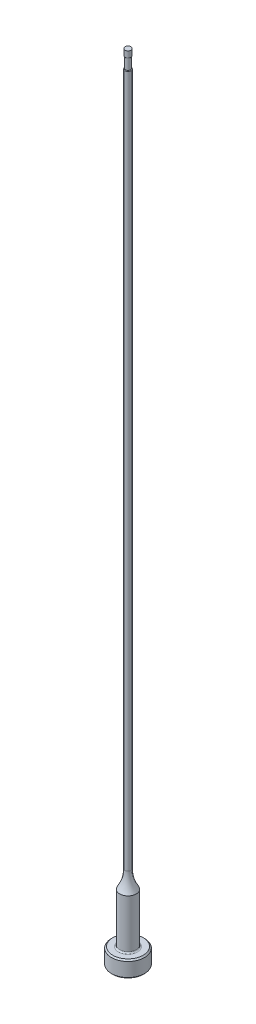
ISO-10303-21;
HEADER;
FILE_DESCRIPTION(('STEP AP214'),'2;1');
FILE_NAME('part.step','',(''),(''),'','','');
FILE_SCHEMA(('AUTOMOTIVE_DESIGN { 1 0 10303 214 1 1 1 1 }'));
ENDSEC;
DATA;
#1=APPLICATION_CONTEXT('core data for automotive mechanical design processes');
#2=APPLICATION_PROTOCOL_DEFINITION('international standard','automotive_design',2000,#1);
#3=PRODUCT_CONTEXT('',#1,'mechanical');
#4=PRODUCT('Part','Part','',(#3));
#5=PRODUCT_RELATED_PRODUCT_CATEGORY('part','',(#4));
#6=PRODUCT_DEFINITION_FORMATION('','',#4);
#7=PRODUCT_DEFINITION_CONTEXT('part definition',#1,'design');
#8=PRODUCT_DEFINITION('design','',#6,#7);
#9=PRODUCT_DEFINITION_SHAPE('','',#8);
#10=(LENGTH_UNIT() NAMED_UNIT(*) SI_UNIT(.MILLI.,.METRE.));
#11=(NAMED_UNIT(*) PLANE_ANGLE_UNIT() SI_UNIT($,.RADIAN.));
#12=(NAMED_UNIT(*) SI_UNIT($,.STERADIAN.) SOLID_ANGLE_UNIT());
#13=UNCERTAINTY_MEASURE_WITH_UNIT(LENGTH_MEASURE(1.E-05),#10,'distance_accuracy_value','');
#14=(GEOMETRIC_REPRESENTATION_CONTEXT(3) GLOBAL_UNCERTAINTY_ASSIGNED_CONTEXT((#13)) GLOBAL_UNIT_ASSIGNED_CONTEXT((#10,
#11,#12)) REPRESENTATION_CONTEXT('',''));
#15=CARTESIAN_POINT('',(0.,0.,0.));
#16=DIRECTION('',(0.,0.,1.));
#17=DIRECTION('',(1.,0.,0.));
#18=AXIS2_PLACEMENT_3D('',#15,#16,#17);
#19=CARTESIAN_POINT('',(0.,259.958771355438,0.));
#20=DIRECTION('',(0.,1.,0.));
#21=DIRECTION('',(0.,0.,1.));
#22=AXIS2_PLACEMENT_3D('',#19,#20,#21);
#23=CYLINDRICAL_SURFACE('',#22,0.594359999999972);
#24=DIRECTION('',(0.,1.,0.));
#25=VECTOR('',#24,1.);
#26=CARTESIAN_POINT('',(-0.492759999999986,259.958771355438,-0.332342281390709));
#27=LINE('',#26,#25);
#28=CARTESIAN_POINT('',(-0.492759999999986,148.973565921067,-0.332342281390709));
#29=VERTEX_POINT('',#28);
#30=CARTESIAN_POINT('',(-0.492759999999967,112.014,-0.332342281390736));
#31=VERTEX_POINT('',#30);
#32=EDGE_CURVE('E66',#29,#31,#27,.F.);
#33=ORIENTED_EDGE('',*,*,#32,.F.);
#34=CARTESIAN_POINT('',(0.,148.973565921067,0.));
#35=DIRECTION('',(0.,1.,0.));
#36=DIRECTION('',(0.,0.,1.));
#37=AXIS2_PLACEMENT_3D('',#34,#35,#36);
#38=CIRCLE('',#37,0.594359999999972);
#39=CARTESIAN_POINT('',(-0.492759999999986,148.973565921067,0.332342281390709));
#40=VERTEX_POINT('',#39);
#41=EDGE_CURVE('E44',#29,#40,#38,.F.);
#42=ORIENTED_EDGE('',*,*,#41,.T.);
#43=DIRECTION('',(0.,1.,0.));
#44=VECTOR('',#43,1.);
#45=CARTESIAN_POINT('',(-0.492759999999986,259.958771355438,0.332342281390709));
#46=LINE('',#45,#44);
#47=CARTESIAN_POINT('',(-0.492759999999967,112.014,0.332342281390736));
#48=VERTEX_POINT('',#47);
#49=EDGE_CURVE('E72',#48,#40,#46,.T.);
#50=ORIENTED_EDGE('',*,*,#49,.F.);
#51=CARTESIAN_POINT('',(-0.492759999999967,112.014,-0.332342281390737));
#52=CARTESIAN_POINT('',(-0.492756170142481,111.975819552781,-0.332315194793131));
#53=CARTESIAN_POINT('',(-0.493448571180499,111.937629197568,-0.331319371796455));
#54=CARTESIAN_POINT('',(-0.496205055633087,111.861285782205,-0.32719484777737));
#55=CARTESIAN_POINT('',(-0.498273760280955,111.823133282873,-0.324058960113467));
#56=CARTESIAN_POINT('',(-0.503877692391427,111.745578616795,-0.315274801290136));
#57=CARTESIAN_POINT('',(-0.507471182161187,111.70619174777,-0.309525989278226));
#58=CARTESIAN_POINT('',(-0.516046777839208,111.628172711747,-0.295012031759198));
#59=CARTESIAN_POINT('',(-0.521026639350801,111.589539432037,-0.286251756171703));
#60=CARTESIAN_POINT('',(-0.532127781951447,111.51413215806,-0.265038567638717));
#61=CARTESIAN_POINT('',(-0.538229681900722,111.477338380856,-0.252646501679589));
#62=CARTESIAN_POINT('',(-0.551257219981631,111.406296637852,-0.222825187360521));
#63=CARTESIAN_POINT('',(-0.55817243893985,111.372024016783,-0.205456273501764));
#64=CARTESIAN_POINT('',(-0.567358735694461,111.329706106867,-0.177255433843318));
#65=CARTESIAN_POINT('',(-0.569648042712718,111.319427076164,-0.169801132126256));
#66=CARTESIAN_POINT('',(-0.574154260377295,111.299625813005,-0.15388318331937));
#67=CARTESIAN_POINT('',(-0.576371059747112,111.29010471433,-0.14541806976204));
#68=CARTESIAN_POINT('',(-0.580650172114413,111.27206685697,-0.127266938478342));
#69=CARTESIAN_POINT('',(-0.582710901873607,111.263559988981,-0.1175705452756));
#70=CARTESIAN_POINT('',(-0.586499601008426,111.248152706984,-0.0969103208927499));
#71=CARTESIAN_POINT('',(-0.588228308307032,111.241248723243,-0.0859493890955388));
#72=CARTESIAN_POINT('',(-0.590708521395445,111.231442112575,-0.0662855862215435));
#73=CARTESIAN_POINT('',(-0.591597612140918,111.22796041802,-0.0578911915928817));
#74=CARTESIAN_POINT('',(-0.593032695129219,111.222365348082,-0.040629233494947));
#75=CARTESIAN_POINT('',(-0.593579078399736,111.220250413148,-0.0317622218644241));
#76=CARTESIAN_POINT('',(-0.594270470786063,111.217577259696,-0.0137206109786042));
#77=CARTESIAN_POINT('',(-0.594413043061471,111.217028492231,-0.00454448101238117));
#78=CARTESIAN_POINT('',(-0.59427126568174,111.217575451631,0.0137560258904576));
#79=CARTESIAN_POINT('',(-0.593986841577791,111.218671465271,0.022880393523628));
#80=CARTESIAN_POINT('',(-0.593063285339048,111.222250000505,0.0401088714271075));
#81=CARTESIAN_POINT('',(-0.592452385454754,111.224622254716,0.048238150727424));
#82=CARTESIAN_POINT('',(-0.590952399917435,111.230489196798,0.0640487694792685));
#83=CARTESIAN_POINT('',(-0.590063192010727,111.23398437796,0.0717299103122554));
#84=CARTESIAN_POINT('',(-0.587497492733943,111.244163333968,0.0908266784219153));
#85=CARTESIAN_POINT('',(-0.585661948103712,111.251526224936,0.101857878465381));
#86=CARTESIAN_POINT('',(-0.581672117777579,111.267837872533,0.122611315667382));
#87=CARTESIAN_POINT('',(-0.579516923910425,111.27679116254,0.132329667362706));
#88=CARTESIAN_POINT('',(-0.573410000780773,111.302730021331,0.157262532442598));
#89=CARTESIAN_POINT('',(-0.569297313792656,111.320800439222,0.171297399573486));
#90=CARTESIAN_POINT('',(-0.561050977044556,111.358739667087,0.196626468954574));
#91=CARTESIAN_POINT('',(-0.55691730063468,111.378613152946,0.20791324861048));
#92=CARTESIAN_POINT('',(-0.548723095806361,111.420118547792,0.22868113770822));
#93=CARTESIAN_POINT('',(-0.544669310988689,111.44178661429,0.238091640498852));
#94=CARTESIAN_POINT('',(-0.536909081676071,111.485888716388,0.255105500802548));
#95=CARTESIAN_POINT('',(-0.533203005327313,111.50832353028,0.262706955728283));
#96=CARTESIAN_POINT('',(-0.522705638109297,111.576539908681,0.283349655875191));
#97=CARTESIAN_POINT('',(-0.516562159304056,111.623099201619,0.29416845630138));
#98=CARTESIAN_POINT('',(-0.508338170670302,111.698558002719,0.308040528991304));
#99=CARTESIAN_POINT('',(-0.505611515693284,111.727164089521,0.312472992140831));
#100=CARTESIAN_POINT('',(-0.50092453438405,111.784636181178,0.319935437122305));
#101=CARTESIAN_POINT('',(-0.498964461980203,111.813502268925,0.32296495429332));
#102=CARTESIAN_POINT('',(-0.495855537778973,111.870951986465,0.327718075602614));
#103=CARTESIAN_POINT('',(-0.494695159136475,111.899533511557,0.329460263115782));
#104=CARTESIAN_POINT('',(-0.493147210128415,111.956743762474,0.331767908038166));
#105=CARTESIAN_POINT('',(-0.492759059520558,111.985372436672,0.332334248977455));
#106=CARTESIAN_POINT('',(-0.492759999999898,112.013999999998,0.332342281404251));
#107=B_SPLINE_CURVE_WITH_KNOTS('',3,(#51,#52,#53,#54,#55,#56,#57,#58,#59,#60,#61,#62,#63,#64,
#65,#66,#67,#68,#69,#70,#71,#72,#73,#74,#75,#76,#77,#78,#79,#80,#81,#82,#83,#84,#85,#86,#87,#88,
#89,#90,#91,#92,#93,#94,#95,#96,#97,#98,#99,#100,#101,#102,#103,#104,#105,#106),.UNSPECIFIED.,
.F.,.F.,(4,2,2,2,2,2,2,2,2,2,2,2,2,2,2,2,2,2,2,2,2,2,2,2,2,2,2,4),(0.,0.114538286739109,
0.229463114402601,0.349243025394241,0.468830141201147,0.586518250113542,0.702835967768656,
0.741495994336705,0.780212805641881,0.819280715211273,0.85826076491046,0.885552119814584,
0.912812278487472,0.940236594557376,0.967665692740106,0.993035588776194,1.01841664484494,
1.05835278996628,1.09840465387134,1.16775387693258,1.23728838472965,1.30908278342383,
1.38095235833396,1.52513678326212,1.61233352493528,1.69955912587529,1.78549956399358,
1.87137540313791),.UNSPECIFIED.);
#108=EDGE_CURVE('E74',#31,#48,#107,.T.);
#109=ORIENTED_EDGE('',*,*,#108,.F.);
#110=EDGE_LOOP('',(#33,#42,#50,#109));
#111=FACE_BOUND('',#110,.T.);
#112=CARTESIAN_POINT('',(0.,16.1097728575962,0.));
#113=DIRECTION('',(0.,1.,0.));
#114=DIRECTION('',(0.,0.,1.));
#115=AXIS2_PLACEMENT_3D('',#112,#113,#114);
#116=CIRCLE('',#115,0.594359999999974);
#117=CARTESIAN_POINT('',(0.,16.1097728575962,0.594359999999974));
#118=VERTEX_POINT('',#117);
#119=EDGE_CURVE('E95',#118,#118,#116,.T.);
#120=ORIENTED_EDGE('',*,*,#119,.T.);
#121=EDGE_LOOP('',(#120));
#122=FACE_BOUND('',#121,.T.);
#123=ADVANCED_FACE('F36',(#111,#122),#23,.T.);
#124=CARTESIAN_POINT('',(0.,16.1097728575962,0.));
#125=DIRECTION('',(0.,1.,0.));
#126=DIRECTION('',(0.,0.,1.));
#127=AXIS2_PLACEMENT_3D('',#124,#125,#126);
#128=TOROIDAL_SURFACE('',#127,6.94435999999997,6.35);
#129=CARTESIAN_POINT('',(0.,12.7,0.));
#130=DIRECTION('',(0.,1.,0.));
#131=DIRECTION('',(0.,0.,1.));
#132=AXIS2_PLACEMENT_3D('',#129,#130,#131);
#133=CIRCLE('',#132,1.58749999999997);
#134=CARTESIAN_POINT('',(0.,12.7,1.58749999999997));
#135=VERTEX_POINT('',#134);
#136=EDGE_CURVE('E92',#135,#135,#133,.T.);
#137=ORIENTED_EDGE('',*,*,#136,.T.);
#138=EDGE_LOOP('',(#137));
#139=FACE_BOUND('',#138,.T.);
#140=ORIENTED_EDGE('',*,*,#119,.F.);
#141=EDGE_LOOP('',(#140));
#142=FACE_BOUND('',#141,.T.);
#143=ADVANCED_FACE('F156',(#139,#142),#128,.F.);
#144=CARTESIAN_POINT('',(0.,259.958771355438,0.));
#145=DIRECTION('',(0.,1.,0.));
#146=DIRECTION('',(0.,0.,1.));
#147=AXIS2_PLACEMENT_3D('',#144,#145,#146);
#148=CYLINDRICAL_SURFACE('',#147,1.58749999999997);
#149=CARTESIAN_POINT('',(0.,3.42900000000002,0.));
#150=DIRECTION('',(0.,1.,0.));
#151=DIRECTION('',(0.,0.,1.));
#152=AXIS2_PLACEMENT_3D('',#149,#150,#151);
#153=CIRCLE('',#152,1.58749999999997);
#154=CARTESIAN_POINT('',(0.,3.42900000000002,1.58749999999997));
#155=VERTEX_POINT('',#154);
#156=EDGE_CURVE('E110',#155,#155,#153,.T.);
#157=ORIENTED_EDGE('',*,*,#156,.T.);
#158=EDGE_LOOP('',(#157));
#159=FACE_BOUND('',#158,.T.);
#160=ORIENTED_EDGE('',*,*,#136,.F.);
#161=EDGE_LOOP('',(#160));
#162=FACE_BOUND('',#161,.T.);
#163=ADVANCED_FACE('F153',(#159,#162),#148,.T.);
#164=CARTESIAN_POINT('',(-3.17499999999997,3.175,0.));
#165=DIRECTION('',(0.,1.,0.));
#166=DIRECTION('',(0.,0.,1.));
#167=AXIS2_PLACEMENT_3D('',#164,#165,#166);
#168=PLANE('',#167);
#169=CARTESIAN_POINT('',(0.,3.175,0.));
#170=DIRECTION('',(0.,1.,0.));
#171=DIRECTION('',(0.,0.,1.));
#172=AXIS2_PLACEMENT_3D('',#169,#170,#171);
#173=CIRCLE('',#172,1.84149999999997);
#174=CARTESIAN_POINT('',(0.,3.175,1.84149999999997));
#175=VERTEX_POINT('',#174);
#176=EDGE_CURVE('E78',#175,#175,#173,.F.);
#177=ORIENTED_EDGE('',*,*,#176,.T.);
#178=EDGE_LOOP('',(#177));
#179=FACE_BOUND('',#178,.T.);
#180=CARTESIAN_POINT('',(0.,3.175,0.));
#181=DIRECTION('',(0.,1.,0.));
#182=DIRECTION('',(0.,0.,1.));
#183=AXIS2_PLACEMENT_3D('',#180,#181,#182);
#184=CIRCLE('',#183,2.92099999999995);
#185=CARTESIAN_POINT('',(0.,3.175,2.92099999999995));
#186=VERTEX_POINT('',#185);
#187=EDGE_CURVE('E98',#186,#186,#184,.T.);
#188=ORIENTED_EDGE('',*,*,#187,.T.);
#189=EDGE_LOOP('',(#188));
#190=FACE_BOUND('',#189,.T.);
#191=ADVANCED_FACE('F149',(#179,#190),#168,.T.);
#192=CARTESIAN_POINT('',(0.,259.958771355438,0.));
#193=DIRECTION('',(0.,1.,0.));
#194=DIRECTION('',(0.,0.,1.));
#195=AXIS2_PLACEMENT_3D('',#192,#193,#194);
#196=CYLINDRICAL_SURFACE('',#195,3.17499999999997);
#197=CARTESIAN_POINT('',(0.,2.92100000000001,0.));
#198=DIRECTION('',(0.,1.,0.));
#199=DIRECTION('',(0.,0.,1.));
#200=AXIS2_PLACEMENT_3D('',#197,#198,#199);
#201=CIRCLE('',#200,3.17499999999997);
#202=CARTESIAN_POINT('',(0.,2.92100000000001,3.17499999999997));
#203=VERTEX_POINT('',#202);
#204=EDGE_CURVE('E104',#203,#203,#201,.F.);
#205=ORIENTED_EDGE('',*,*,#204,.T.);
#206=EDGE_LOOP('',(#205));
#207=FACE_BOUND('',#206,.T.);
#208=CARTESIAN_POINT('',(0.,0.254000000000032,0.));
#209=DIRECTION('',(0.,-1.,0.));
#210=DIRECTION('',(0.,0.,-1.));
#211=AXIS2_PLACEMENT_3D('',#208,#209,#210);
#212=CIRCLE('',#211,3.17499999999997);
#213=CARTESIAN_POINT('',(0.,0.254000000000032,-3.17499999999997));
#214=VERTEX_POINT('',#213);
#215=EDGE_CURVE('E101',#214,#214,#212,.F.);
#216=ORIENTED_EDGE('',*,*,#215,.T.);
#217=EDGE_LOOP('',(#216));
#218=FACE_BOUND('',#217,.T.);
#219=ADVANCED_FACE('F145',(#207,#218),#196,.T.);
#220=CARTESIAN_POINT('',(0.,0.,0.));
#221=DIRECTION('',(0.,-1.,0.));
#222=DIRECTION('',(0.,0.,-1.));
#223=AXIS2_PLACEMENT_3D('',#220,#221,#222);
#224=PLANE('',#223);
#225=CARTESIAN_POINT('',(0.,0.,0.));
#226=DIRECTION('',(0.,-1.,0.));
#227=DIRECTION('',(0.,0.,-1.));
#228=AXIS2_PLACEMENT_3D('',#225,#226,#227);
#229=CIRCLE('',#228,2.92099999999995);
#230=CARTESIAN_POINT('',(0.,0.,-2.92099999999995));
#231=VERTEX_POINT('',#230);
#232=EDGE_CURVE('E107',#231,#231,#229,.T.);
#233=ORIENTED_EDGE('',*,*,#232,.T.);
#234=EDGE_LOOP('',(#233));
#235=FACE_BOUND('',#234,.T.);
#236=ADVANCED_FACE('F141',(#235),#224,.T.);
#237=CARTESIAN_POINT('',(0.,3.17499999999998,0.));
#238=DIRECTION('',(0.,-1.,0.));
#239=DIRECTION('',(0.,0.,-1.));
#240=AXIS2_PLACEMENT_3D('',#237,#238,#239);
#241=CONICAL_SURFACE('',#240,2.92099999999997,0.7853981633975);
#242=ORIENTED_EDGE('',*,*,#204,.F.);
#243=EDGE_LOOP('',(#242));
#244=FACE_BOUND('',#243,.T.);
#245=ORIENTED_EDGE('',*,*,#187,.F.);
#246=EDGE_LOOP('',(#245));
#247=FACE_BOUND('',#246,.T.);
#248=ADVANCED_FACE('F144',(#244,#247),#241,.T.);
#249=CARTESIAN_POINT('',(0.,0.254000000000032,0.));
#250=DIRECTION('',(0.,1.,0.));
#251=DIRECTION('',(0.,0.,1.));
#252=AXIS2_PLACEMENT_3D('',#249,#250,#251);
#253=CONICAL_SURFACE('',#252,3.17499999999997,0.785398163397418);
#254=ORIENTED_EDGE('',*,*,#232,.F.);
#255=EDGE_LOOP('',(#254));
#256=FACE_BOUND('',#255,.T.);
#257=ORIENTED_EDGE('',*,*,#215,.F.);
#258=EDGE_LOOP('',(#257));
#259=FACE_BOUND('',#258,.T.);
#260=ADVANCED_FACE('F245',(#256,#259),#253,.T.);
#261=CARTESIAN_POINT('',(0.,3.42900000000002,0.));
#262=DIRECTION('',(0.,1.,0.));
#263=DIRECTION('',(0.,0.,1.));
#264=AXIS2_PLACEMENT_3D('',#261,#262,#263);
#265=TOROIDAL_SURFACE('',#264,1.84149999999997,0.254);
#266=ORIENTED_EDGE('',*,*,#176,.F.);
#267=EDGE_LOOP('',(#266));
#268=FACE_BOUND('',#267,.T.);
#269=ORIENTED_EDGE('',*,*,#156,.F.);
#270=EDGE_LOOP('',(#269));
#271=FACE_BOUND('',#270,.T.);
#272=ADVANCED_FACE('F139',(#268,#271),#265,.F.);
#273=CARTESIAN_POINT('',(0.,153.448281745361,0.));
#274=DIRECTION('',(0.,1.,0.));
#275=DIRECTION('',(0.,0.,1.));
#276=AXIS2_PLACEMENT_3D('',#273,#274,#275);
#277=CYLINDRICAL_SURFACE('',#276,0.492759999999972);
#278=CARTESIAN_POINT('',(0.,151.13,0.));
#279=DIRECTION('',(0.,1.,0.));
#280=DIRECTION('',(0.,0.,1.));
#281=AXIS2_PLACEMENT_3D('',#278,#279,#280);
#282=CIRCLE('',#281,0.492759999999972);
#283=CARTESIAN_POINT('',(0.,151.13,0.492759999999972));
#284=VERTEX_POINT('',#283);
#285=EDGE_CURVE('E71',#284,#284,#282,.T.);
#286=ORIENTED_EDGE('',*,*,#285,.F.);
#287=EDGE_LOOP('',(#286));
#288=FACE_BOUND('',#287,.T.);
#289=CARTESIAN_POINT('',(0.,149.098,0.));
#290=DIRECTION('',(0.,1.,0.));
#291=DIRECTION('',(0.,0.,1.));
#292=AXIS2_PLACEMENT_3D('',#289,#290,#291);
#293=CIRCLE('',#292,0.492759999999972);
#294=CARTESIAN_POINT('',(-0.492759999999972,149.098,0.));
#295=VERTEX_POINT('',#294);
#296=EDGE_CURVE('E89',#295,#295,#293,.T.);
#297=ORIENTED_EDGE('',*,*,#296,.T.);
#298=EDGE_LOOP('',(#297));
#299=FACE_BOUND('',#298,.T.);
#300=ADVANCED_FACE('F136',(#288,#299),#277,.T.);
#301=CARTESIAN_POINT('',(-0.492759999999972,150.114,-3.17499999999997));
#302=DIRECTION('',(1.,0.,0.));
#303=DIRECTION('',(0.,1.,0.));
#304=AXIS2_PLACEMENT_3D('',#301,#302,#303);
#305=PLANE('',#304);
#306=CARTESIAN_POINT('',(-0.492759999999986,148.973565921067,0.332342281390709));
#307=CARTESIAN_POINT('',(-0.492759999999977,148.97845108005,0.332357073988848));
#308=CARTESIAN_POINT('',(-0.492759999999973,148.983318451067,0.331839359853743));
#309=CARTESIAN_POINT('',(-0.492759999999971,148.992805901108,0.329871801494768));
#310=CARTESIAN_POINT('',(-0.492759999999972,148.997428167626,0.32843265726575));
#311=CARTESIAN_POINT('',(-0.492759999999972,149.006313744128,0.324757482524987));
#312=CARTESIAN_POINT('',(-0.492759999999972,149.010578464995,0.322524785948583));
#313=CARTESIAN_POINT('',(-0.492759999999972,149.018714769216,0.317418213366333));
#314=CARTESIAN_POINT('',(-0.492759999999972,149.022585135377,0.314542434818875));
#315=CARTESIAN_POINT('',(-0.492759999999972,149.031640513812,0.306816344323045));
#316=CARTESIAN_POINT('',(-0.492759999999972,149.036577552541,0.301676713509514));
#317=CARTESIAN_POINT('',(-0.492759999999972,149.045587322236,0.29070118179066));
#318=CARTESIAN_POINT('',(-0.492759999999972,149.049658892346,0.284864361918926));
#319=CARTESIAN_POINT('',(-0.492759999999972,149.059607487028,0.268553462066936));
#320=CARTESIAN_POINT('',(-0.492759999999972,149.064790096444,0.257660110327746));
#321=CARTESIAN_POINT('',(-0.492759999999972,149.073580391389,0.235187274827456));
#322=CARTESIAN_POINT('',(-0.492759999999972,149.077173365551,0.223602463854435));
#323=CARTESIAN_POINT('',(-0.492759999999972,149.084704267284,0.19416767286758));
#324=CARTESIAN_POINT('',(-0.492759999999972,149.087886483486,0.176130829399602));
#325=CARTESIAN_POINT('',(-0.492759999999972,149.092644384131,0.13980987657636));
#326=CARTESIAN_POINT('',(-0.492759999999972,149.094213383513,0.121525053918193));
#327=CARTESIAN_POINT('',(-0.492759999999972,149.096380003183,0.0859638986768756));
#328=CARTESIAN_POINT('',(-0.492759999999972,149.09702849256,0.0686903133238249));
#329=CARTESIAN_POINT('',(-0.492759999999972,149.097816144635,0.0342749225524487));
#330=CARTESIAN_POINT('',(-0.492759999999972,149.097959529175,0.0171332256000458));
#331=CARTESIAN_POINT('',(-0.492759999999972,149.098,0.));
#332=B_SPLINE_CURVE_WITH_KNOTS('',3,(#306,#307,#308,#309,#310,#311,#312,#313,#314,#315,#316,
#317,#318,#319,#320,#321,#322,#323,#324,#325,#326,#327,#328,#329,#330,#331),.UNSPECIFIED.,.F.,
.F.,(4,2,2,2,2,2,2,2,2,2,2,2,4),(0.,0.0145999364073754,0.0290333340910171,0.0434067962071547,
0.0578233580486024,0.0790827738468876,0.100370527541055,0.136356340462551,0.172668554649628,
0.227468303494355,0.282494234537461,0.334342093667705,0.38575554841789),.UNSPECIFIED.);
#333=EDGE_CURVE('E77',#40,#295,#332,.T.);
#334=ORIENTED_EDGE('',*,*,#333,.T.);
#335=CARTESIAN_POINT('',(-0.492759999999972,149.098,0.));
#336=CARTESIAN_POINT('',(-0.492759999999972,149.097956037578,-0.0174712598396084));
#337=CARTESIAN_POINT('',(-0.492759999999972,149.097808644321,-0.0349524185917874));
#338=CARTESIAN_POINT('',(-0.492759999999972,149.096987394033,-0.0700519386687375));
#339=CARTESIAN_POINT('',(-0.492759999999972,149.096308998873,-0.0876701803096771));
#340=CARTESIAN_POINT('',(-0.492759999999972,149.094066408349,-0.123326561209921));
#341=CARTESIAN_POINT('',(-0.492759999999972,149.092479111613,-0.141363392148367));
#342=CARTESIAN_POINT('',(-0.492759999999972,149.087706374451,-0.177190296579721));
#343=CARTESIAN_POINT('',(-0.492759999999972,149.084527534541,-0.194981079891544));
#344=CARTESIAN_POINT('',(-0.492759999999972,149.077991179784,-0.220348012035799));
#345=CARTESIAN_POINT('',(-0.492759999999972,149.075682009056,-0.228189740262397));
#346=CARTESIAN_POINT('',(-0.492759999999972,149.070387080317,-0.243637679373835));
#347=CARTESIAN_POINT('',(-0.492759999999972,149.067402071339,-0.251244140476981));
#348=CARTESIAN_POINT('',(-0.492759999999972,149.060570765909,-0.266152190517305));
#349=CARTESIAN_POINT('',(-0.492759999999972,149.056716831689,-0.273450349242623));
#350=CARTESIAN_POINT('',(-0.492759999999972,149.047983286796,-0.287413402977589));
#351=CARTESIAN_POINT('',(-0.492759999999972,149.043105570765,-0.294079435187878));
#352=CARTESIAN_POINT('',(-0.492759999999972,149.034143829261,-0.304142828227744));
#353=CARTESIAN_POINT('',(-0.492759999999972,149.030410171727,-0.307850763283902));
#354=CARTESIAN_POINT('',(-0.492759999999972,149.022437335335,-0.314683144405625));
#355=CARTESIAN_POINT('',(-0.492759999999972,149.018198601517,-0.317808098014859));
#356=CARTESIAN_POINT('',(-0.492759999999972,149.009908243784,-0.322875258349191));
#357=CARTESIAN_POINT('',(-0.492759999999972,149.005922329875,-0.324924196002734));
#358=CARTESIAN_POINT('',(-0.492759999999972,148.997667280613,-0.328328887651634));
#359=CARTESIAN_POINT('',(-0.492759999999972,148.993398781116,-0.329686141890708));
#360=CARTESIAN_POINT('',(-0.492759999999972,148.986507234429,-0.331205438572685));
#361=CARTESIAN_POINT('',(-0.492759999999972,148.983940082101,-0.33162986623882));
#362=CARTESIAN_POINT('',(-0.492759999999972,148.978771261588,-0.332199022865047));
#363=CARTESIAN_POINT('',(-0.492759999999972,148.976169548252,-0.33234334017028));
#364=CARTESIAN_POINT('',(-0.492759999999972,148.973565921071,-0.332342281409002));
#365=B_SPLINE_CURVE_WITH_KNOTS('',3,(#335,#336,#337,#338,#339,#340,#341,#342,#343,#344,#345,
#346,#347,#348,#349,#350,#351,#352,#353,#354,#355,#356,#357,#358,#359,#360,#361,#362,#363,#364),
.UNSPECIFIED.,.F.,.F.,(4,2,2,2,2,2,2,2,2,2,2,2,2,2,4),(0.,0.0524301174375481,0.10531327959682,
0.159604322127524,0.21367204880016,0.238172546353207,0.262646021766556,0.287343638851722,
0.311995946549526,0.32773774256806,0.343465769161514,0.356857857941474,0.37022077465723,
0.378012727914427,0.385816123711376),.UNSPECIFIED.);
#366=EDGE_CURVE('E58',#295,#29,#365,.T.);
#367=ORIENTED_EDGE('',*,*,#366,.T.);
#368=ORIENTED_EDGE('',*,*,#32,.T.);
#369=DIRECTION('',(0.,0.,1.));
#370=VECTOR('',#369,1.);
#371=CARTESIAN_POINT('',(-0.492759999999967,112.014,-3.17499999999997));
#372=LINE('',#371,#370);
#373=EDGE_CURVE('E70',#31,#48,#372,.T.);
#374=ORIENTED_EDGE('',*,*,#373,.T.);
#375=ORIENTED_EDGE('',*,*,#49,.T.);
#376=EDGE_LOOP('',(#334,#367,#368,#374,#375));
#377=FACE_BOUND('',#376,.T.);
#378=ADVANCED_FACE('F68',(#377),#305,.F.);
#379=CARTESIAN_POINT('',(-3.66775999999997,112.014,-3.17499999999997));
#380=DIRECTION('',(0.,0.,1.));
#381=DIRECTION('',(1.,0.,0.));
#382=AXIS2_PLACEMENT_3D('',#379,#380,#381);
#383=CYLINDRICAL_SURFACE('',#382,3.175);
#384=ORIENTED_EDGE('',*,*,#373,.F.);
#385=ORIENTED_EDGE('',*,*,#108,.T.);
#386=EDGE_LOOP('',(#384,#385));
#387=FACE_BOUND('',#386,.T.);
#388=ADVANCED_FACE('F80',(#387),#383,.F.);
#389=CARTESIAN_POINT('',(0.,152.687735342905,0.));
#390=DIRECTION('',(0.,1.,0.));
#391=DIRECTION('',(0.,0.,1.));
#392=AXIS2_PLACEMENT_3D('',#389,#390,#391);
#393=CYLINDRICAL_SURFACE('',#392,0.575309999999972);
#394=CARTESIAN_POINT('',(0.,151.24896721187,0.));
#395=DIRECTION('',(0.,-1.,0.));
#396=DIRECTION('',(0.,0.,-1.));
#397=AXIS2_PLACEMENT_3D('',#394,#395,#396);
#398=CIRCLE('',#397,0.575309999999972);
#399=CARTESIAN_POINT('',(0.,151.24896721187,-0.575309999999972));
#400=VERTEX_POINT('',#399);
#401=EDGE_CURVE('E11',#400,#400,#398,.F.);
#402=ORIENTED_EDGE('',*,*,#401,.T.);
#403=EDGE_LOOP('',(#402));
#404=FACE_BOUND('',#403,.T.);
#405=CARTESIAN_POINT('',(0.,152.4,0.));
#406=DIRECTION('',(0.,1.,0.));
#407=DIRECTION('',(0.,0.,1.));
#408=AXIS2_PLACEMENT_3D('',#405,#406,#407);
#409=CIRCLE('',#408,0.575309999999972);
#410=CARTESIAN_POINT('',(0.,152.4,0.575309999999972));
#411=VERTEX_POINT('',#410);
#412=EDGE_CURVE('E81',#411,#411,#409,.T.);
#413=ORIENTED_EDGE('',*,*,#412,.F.);
#414=EDGE_LOOP('',(#413));
#415=FACE_BOUND('',#414,.T.);
#416=ADVANCED_FACE('F133',(#404,#415),#393,.T.);
#417=CARTESIAN_POINT('',(-0.59435999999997,152.4,0.));
#418=DIRECTION('',(0.,1.,0.));
#419=DIRECTION('',(0.,0.,1.));
#420=AXIS2_PLACEMENT_3D('',#417,#418,#419);
#421=PLANE('',#420);
#422=ORIENTED_EDGE('',*,*,#412,.T.);
#423=EDGE_LOOP('',(#422));
#424=FACE_BOUND('',#423,.T.);
#425=ADVANCED_FACE('F177',(#424),#421,.T.);
#426=CARTESIAN_POINT('',(0.,148.973565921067,0.));
#427=DIRECTION('',(0.,1.,0.));
#428=DIRECTION('',(0.,0.,1.));
#429=AXIS2_PLACEMENT_3D('',#426,#427,#428);
#430=TOROIDAL_SURFACE('',#429,0.467359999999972,0.127);
#431=ORIENTED_EDGE('',*,*,#333,.F.);
#432=ORIENTED_EDGE('',*,*,#41,.F.);
#433=ORIENTED_EDGE('',*,*,#366,.F.);
#434=ORIENTED_EDGE('',*,*,#296,.F.);
#435=EDGE_LOOP('',(#431,#432,#433,#434));
#436=FACE_BOUND('',#435,.T.);
#437=ADVANCED_FACE('F209',(#436),#430,.T.);
#438=CARTESIAN_POINT('',(0.,151.24896721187,0.));
#439=DIRECTION('',(0.,-1.,0.));
#440=DIRECTION('',(0.,0.,-1.));
#441=AXIS2_PLACEMENT_3D('',#438,#439,#440);
#442=TOROIDAL_SURFACE('',#441,0.448309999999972,0.127);
#443=ORIENTED_EDGE('',*,*,#285,.T.);
#444=EDGE_LOOP('',(#443));
#445=FACE_BOUND('',#444,.T.);
#446=ORIENTED_EDGE('',*,*,#401,.F.);
#447=EDGE_LOOP('',(#446));
#448=FACE_BOUND('',#447,.T.);
#449=ADVANCED_FACE('F38',(#445,#448),#442,.T.);
#450=CLOSED_SHELL('',(#123,#143,#163,#191,#219,#236,#248,#260,#272,#300,#378,#388,#416,#425,
#437,#449));
#451=MANIFOLD_SOLID_BREP('B2',#450);
#452=ADVANCED_BREP_SHAPE_REPRESENTATION('',(#18,#451),#14);
#453=SHAPE_DEFINITION_REPRESENTATION(#9,#452);
ENDSEC;
END-ISO-10303-21;
